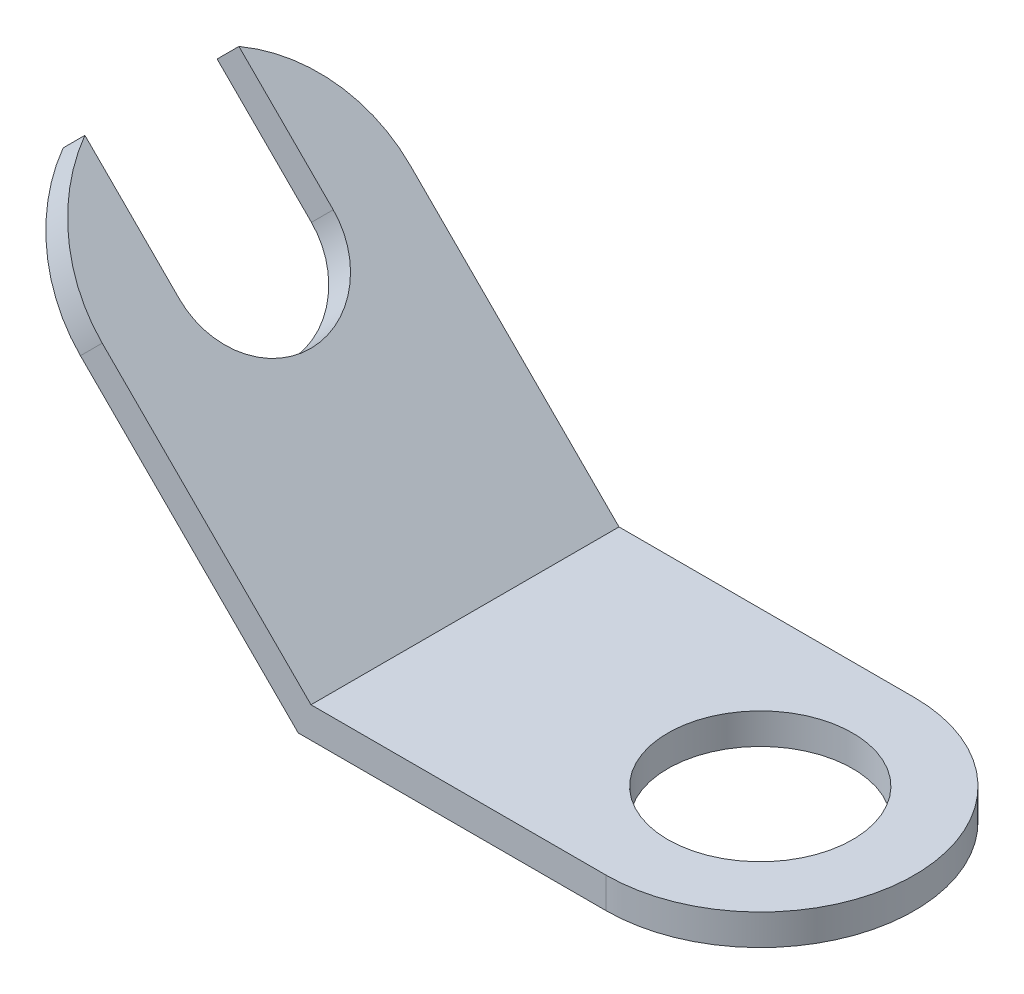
from build123d import *

# Parameters (mm, degrees)
EXTRUDE1_DEPTH     = 50
FILLET1_RADIUS     = 50
FILLET1_LENGTH     = 10
FILLET2_RADIUS     = 50
FILLET2_LENGTH     = 10
CUT_EXTRUDE1_DEPTH = 266.857979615
SKETCH3_R          = 30
CUT_EXTRUDE2_DEPTH = 588.721032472


with BuildPart() as part:
    # Sketch1 → Extrude1 (new, symmetric)
    with BuildSketch(Plane.XY):
        Polygon((0, 0), (-150, 0), (-256.066017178, 106.066017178), (-248.994949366, 113.13708499), (-145.857864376, 10), (0, 10), align=None)
    extrude(amount=EXTRUDE1_DEPTH, both=True)

    # Fillet1: full round fillet: the end face becomes a half cylinder, R = half its width
    fillet1_face = Plane((0, 5, 0), x_dir=(0, -1, 0), z_dir=(1, 0, 0))  # on the end face: x along it, z out of the body
    fillet1_slab = fillet1_face.offset(-FILLET1_RADIUS / 2) * Box(FILLET1_LENGTH, 2 * FILLET1_RADIUS, FILLET1_RADIUS, mode=Mode.PRIVATE)  # the body's end, R deep
    fillet1_round = Plane((-50, 5, 0), x_dir=(1, 0, 0), z_dir=(0, -1, 0)) * Cylinder(FILLET1_RADIUS, FILLET1_LENGTH, mode=Mode.PRIVATE)  # its axis R under the face
    add(fillet1_slab - fillet1_round, mode=Mode.SUBTRACT)

    # Fillet2: full round fillet: the end face becomes a half cylinder, R = half its width
    fillet2_face = Plane((-252.530483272, 109.601551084, 0), x_dir=(0.707106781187, 0.707106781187, 0), z_dir=(-0.707106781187, 0.707106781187, 0))  # on the end face: x along it, z out of the body
    fillet2_slab = fillet2_face.offset(-FILLET2_RADIUS / 2) * Box(FILLET2_LENGTH, 2 * FILLET2_RADIUS, FILLET2_RADIUS, mode=Mode.PRIVATE)  # the body's end, R deep
    fillet2_round = Plane((-217.175144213, 74.246212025, 0), x_dir=(-0.707106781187, 0.707106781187, 0), z_dir=(0.707106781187, 0.707106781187, 0)) * Cylinder(FILLET2_RADIUS, FILLET2_LENGTH, mode=Mode.PRIVATE)  # its axis R under the face
    add(fillet2_slab - fillet2_round, mode=Mode.SUBTRACT)

    # Sketch2 → Cut-Extrude1 (cut, through all)
    with BuildSketch(Plane(origin=(-67.928932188, -67.928932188, 0), x_dir=(0, 0, 1), z_dir=(0.7071067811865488, 0.7071067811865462, 0))):
        with BuildLine():
            Line((-25, -206.066017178), (-25, -256.066017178))
            Line((-25, -256.066017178), (25, -256.066017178))
            Line((25, -256.066017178), (25, -206.066017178))
            ThreePointArc((25, -206.066017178), (0, -181.066017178), (-25, -206.066017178))
        make_face()
    extrude(amount=-CUT_EXTRUDE1_DEPTH, mode=Mode.SUBTRACT)

    # Sketch3 → Cut-Extrude2 (cut, through all)
    with BuildSketch(Plane(origin=(322.985387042, 10, -26.785545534), x_dir=(0, 0, -1), z_dir=(0, 1, 0))):
        with Locations(Location((-26.785545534, 372.985387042, 0), (0, 0, 180))):
            Circle(SKETCH3_R)
    extrude(amount=-CUT_EXTRUDE2_DEPTH, mode=Mode.SUBTRACT)


solid = part.part
